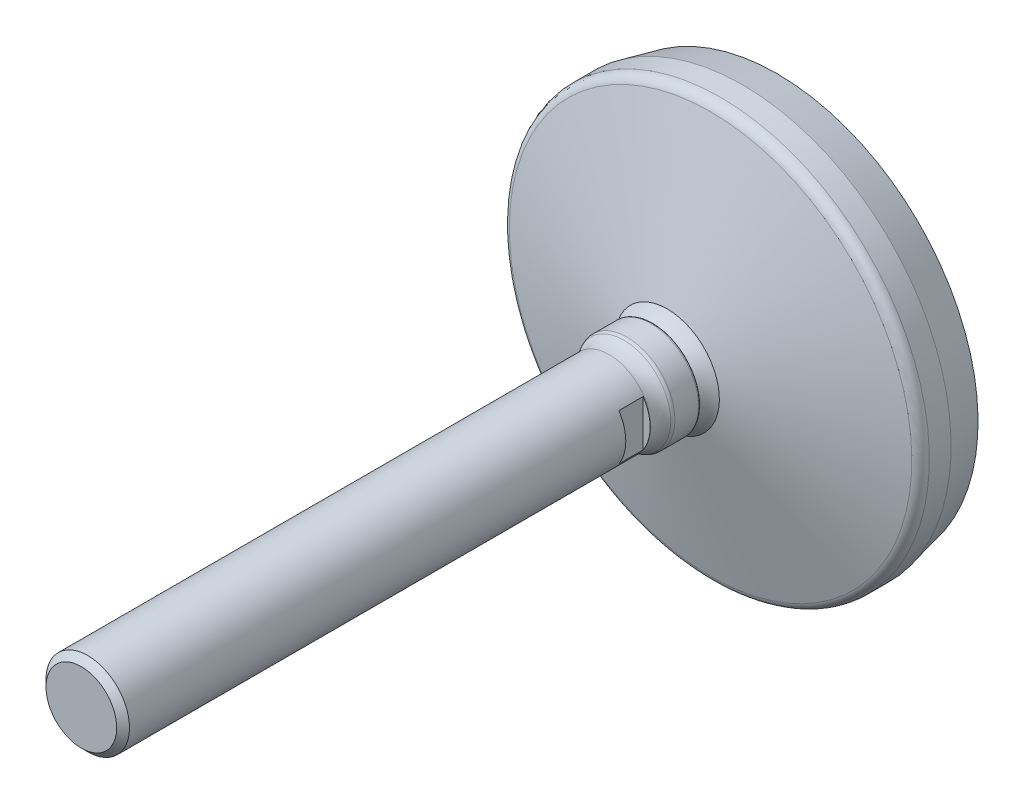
ISO-10303-21;
HEADER;
FILE_DESCRIPTION(('STEP AP214'),'2;1');
FILE_NAME('part.step','',(''),(''),'','','');
FILE_SCHEMA(('AUTOMOTIVE_DESIGN { 1 0 10303 214 1 1 1 1 }'));
ENDSEC;
DATA;
#1=APPLICATION_CONTEXT('core data for automotive mechanical design processes');
#2=APPLICATION_PROTOCOL_DEFINITION('international standard','automotive_design',2000,#1);
#3=PRODUCT_CONTEXT('',#1,'mechanical');
#4=PRODUCT('Part','Part','',(#3));
#5=PRODUCT_RELATED_PRODUCT_CATEGORY('part','',(#4));
#6=PRODUCT_DEFINITION_FORMATION('','',#4);
#7=PRODUCT_DEFINITION_CONTEXT('part definition',#1,'design');
#8=PRODUCT_DEFINITION('design','',#6,#7);
#9=PRODUCT_DEFINITION_SHAPE('','',#8);
#10=(LENGTH_UNIT() NAMED_UNIT(*) SI_UNIT(.MILLI.,.METRE.));
#11=(NAMED_UNIT(*) PLANE_ANGLE_UNIT() SI_UNIT($,.RADIAN.));
#12=(NAMED_UNIT(*) SI_UNIT($,.STERADIAN.) SOLID_ANGLE_UNIT());
#13=UNCERTAINTY_MEASURE_WITH_UNIT(LENGTH_MEASURE(1.E-05),#10,'distance_accuracy_value','');
#14=(GEOMETRIC_REPRESENTATION_CONTEXT(3) GLOBAL_UNCERTAINTY_ASSIGNED_CONTEXT((#13)) GLOBAL_UNIT_ASSIGNED_CONTEXT((#10,
#11,#12)) REPRESENTATION_CONTEXT('',''));
#15=CARTESIAN_POINT('',(0.,0.,0.));
#16=DIRECTION('',(0.,0.,1.));
#17=DIRECTION('',(1.,0.,0.));
#18=AXIS2_PLACEMENT_3D('',#15,#16,#17);
#19=CARTESIAN_POINT('',(0.,0.,40.6420167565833));
#20=DIRECTION('',(0.,0.,-1.));
#21=DIRECTION('',(0.,1.,0.));
#22=AXIS2_PLACEMENT_3D('',#19,#20,#21);
#23=TOROIDAL_SURFACE('',#22,22.8893556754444,12.);
#24=CARTESIAN_POINT('',(0.,0.,31.6));
#25=DIRECTION('',(0.,0.,-1.));
#26=DIRECTION('',(0.,1.,0.));
#27=AXIS2_PLACEMENT_3D('',#24,#25,#26);
#28=CIRCLE('',#27,15.);
#29=CARTESIAN_POINT('',(0.,15.,31.6));
#30=VERTEX_POINT('',#29);
#31=EDGE_CURVE('E86',#30,#30,#28,.T.);
#32=ORIENTED_EDGE('',*,*,#31,.F.);
#33=EDGE_LOOP('',(#32));
#34=FACE_BOUND('',#33,.T.);
#35=CARTESIAN_POINT('',(0.,0.,35.6));
#36=DIRECTION('',(0.,0.,-1.));
#37=DIRECTION('',(0.,1.,0.));
#38=AXIS2_PLACEMENT_3D('',#35,#36,#37);
#39=CIRCLE('',#38,12.);
#40=CARTESIAN_POINT('',(0.,12.,35.6));
#41=VERTEX_POINT('',#40);
#42=EDGE_CURVE('E61',#41,#41,#39,.T.);
#43=ORIENTED_EDGE('',*,*,#42,.T.);
#44=EDGE_LOOP('',(#43));
#45=FACE_BOUND('',#44,.T.);
#46=ADVANCED_FACE('F14',(#34,#45),#23,.F.);
#47=CARTESIAN_POINT('',(0.,0.,31.6));
#48=DIRECTION('',(0.,0.,-1.));
#49=DIRECTION('',(0.,1.,0.));
#50=AXIS2_PLACEMENT_3D('',#47,#48,#49);
#51=CONICAL_SURFACE('',#50,15.,1.2875142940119);
#52=CARTESIAN_POINT('',(0.,0.,19.1292293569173));
#53=DIRECTION('',(0.,0.,-1.));
#54=DIRECTION('',(0.,1.,0.));
#55=AXIS2_PLACEMENT_3D('',#52,#53,#54);
#56=CIRCLE('',#55,57.8385251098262);
#57=CARTESIAN_POINT('',(0.,57.8385251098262,19.1292293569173));
#58=VERTEX_POINT('',#57);
#59=EDGE_CURVE('E89',#58,#58,#56,.T.);
#60=CARTESIAN_POINT('',(0.,57.8385251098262,19.1292293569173));
#61=CARTESIAN_POINT('',(0.,57.3922904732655,19.2591332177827));
#62=CARTESIAN_POINT('',(0.,56.9460558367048,19.3890370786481));
#63=CARTESIAN_POINT('',(0.,56.0535865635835,19.648844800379));
#64=CARTESIAN_POINT('',(0.,55.6073519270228,19.7787486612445));
#65=CARTESIAN_POINT('',(0.,54.7148826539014,20.0385563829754));
#66=CARTESIAN_POINT('',(0.,54.2686480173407,20.1684602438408));
#67=CARTESIAN_POINT('',(0.,53.3761787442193,20.4282679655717));
#68=CARTESIAN_POINT('',(0.,52.9299441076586,20.5581718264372));
#69=CARTESIAN_POINT('',(0.,52.0374748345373,20.817979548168));
#70=CARTESIAN_POINT('',(0.,51.5912401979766,20.9478834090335));
#71=CARTESIAN_POINT('',(0.,50.6987709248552,21.2076911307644));
#72=CARTESIAN_POINT('',(0.,50.2525362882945,21.3375949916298));
#73=CARTESIAN_POINT('',(0.,49.3600670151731,21.5974027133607));
#74=CARTESIAN_POINT('',(0.,48.9138323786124,21.7273065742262));
#75=CARTESIAN_POINT('',(0.,48.021363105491,21.9871142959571));
#76=CARTESIAN_POINT('',(0.,47.5751284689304,22.1170181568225));
#77=CARTESIAN_POINT('',(0.,46.682659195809,22.3768258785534));
#78=CARTESIAN_POINT('',(0.,46.2364245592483,22.5067297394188));
#79=CARTESIAN_POINT('',(0.,45.3439552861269,22.7665374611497));
#80=CARTESIAN_POINT('',(0.,44.8977206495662,22.8964413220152));
#81=CARTESIAN_POINT('',(0.,44.0052513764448,23.1562490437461));
#82=CARTESIAN_POINT('',(0.,43.5590167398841,23.2861529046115));
#83=CARTESIAN_POINT('',(0.,42.6665474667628,23.5459606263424));
#84=CARTESIAN_POINT('',(0.,42.2203128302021,23.6758644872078));
#85=CARTESIAN_POINT('',(0.,41.3278435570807,23.9356722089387));
#86=CARTESIAN_POINT('',(0.,40.88160892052,24.0655760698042));
#87=CARTESIAN_POINT('',(0.,39.9891396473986,24.3253837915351));
#88=CARTESIAN_POINT('',(0.,39.5429050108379,24.4552876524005));
#89=CARTESIAN_POINT('',(0.,38.6504357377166,24.7150953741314));
#90=CARTESIAN_POINT('',(0.,38.2042011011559,24.8449992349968));
#91=CARTESIAN_POINT('',(0.,37.3117318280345,25.1048069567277));
#92=CARTESIAN_POINT('',(0.,36.8654971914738,25.2347108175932));
#93=CARTESIAN_POINT('',(0.,35.9730279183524,25.4945185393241));
#94=CARTESIAN_POINT('',(0.,35.5267932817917,25.6244224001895));
#95=CARTESIAN_POINT('',(0.,34.6343240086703,25.8842301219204));
#96=CARTESIAN_POINT('',(0.,34.1880893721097,26.0141339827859));
#97=CARTESIAN_POINT('',(0.,33.2956200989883,26.2739417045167));
#98=CARTESIAN_POINT('',(0.,32.8493854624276,26.4038455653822));
#99=CARTESIAN_POINT('',(0.,31.9569161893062,26.6636532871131));
#100=CARTESIAN_POINT('',(0.,31.5106815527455,26.7935571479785));
#101=CARTESIAN_POINT('',(0.,30.6182122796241,27.0533648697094));
#102=CARTESIAN_POINT('',(0.,30.1719776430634,27.1832687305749));
#103=CARTESIAN_POINT('',(0.,29.2795083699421,27.4430764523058));
#104=CARTESIAN_POINT('',(0.,28.8332737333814,27.5729803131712));
#105=CARTESIAN_POINT('',(0.,27.94080446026,27.8327880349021));
#106=CARTESIAN_POINT('',(0.,27.4945698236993,27.9626918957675));
#107=CARTESIAN_POINT('',(0.,26.6021005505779,28.2224996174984));
#108=CARTESIAN_POINT('',(0.,26.1558659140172,28.3524034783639));
#109=CARTESIAN_POINT('',(0.,25.2633966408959,28.6122112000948));
#110=CARTESIAN_POINT('',(0.,24.8171620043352,28.7421150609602));
#111=CARTESIAN_POINT('',(0.,23.9246927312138,29.0019227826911));
#112=CARTESIAN_POINT('',(0.,23.4784580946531,29.1318266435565));
#113=CARTESIAN_POINT('',(0.,22.5859888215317,29.3916343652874));
#114=CARTESIAN_POINT('',(0.,22.139754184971,29.5215382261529));
#115=CARTESIAN_POINT('',(0.,21.2472849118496,29.7813459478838));
#116=CARTESIAN_POINT('',(0.,20.801050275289,29.9112498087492));
#117=CARTESIAN_POINT('',(0.,19.9085810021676,30.1710575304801));
#118=CARTESIAN_POINT('',(0.,19.4623463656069,30.3009613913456));
#119=CARTESIAN_POINT('',(0.,18.5698770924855,30.5607691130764));
#120=CARTESIAN_POINT('',(0.,18.1236424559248,30.6906729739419));
#121=CARTESIAN_POINT('',(0.,17.2311731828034,30.9504806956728));
#122=CARTESIAN_POINT('',(0.,16.7849385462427,31.0803845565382));
#123=CARTESIAN_POINT('',(0.,15.8924692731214,31.3401922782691));
#124=CARTESIAN_POINT('',(0.,15.4462346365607,31.4700961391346));
#125=CARTESIAN_POINT('',(0.,15.,31.6));
#126=B_SPLINE_CURVE_WITH_KNOTS('',3,(#60,#61,#62,#63,#64,#65,#66,#67,#68,#69,#70,#71,#72,#73,
#74,#75,#76,#77,#78,#79,#80,#81,#82,#83,#84,#85,#86,#87,#88,#89,#90,#91,#92,#93,#94,#95,#96,#97,
#98,#99,#100,#101,#102,#103,#104,#105,#106,#107,#108,#109,#110,#111,#112,#113,#114,#115,#116,
#117,#118,#119,#120,#121,#122,#123,#124,#125),.UNSPECIFIED.,.F.,.F.,(4,2,2,2,2,2,2,2,2,2,2,2,2,
2,2,2,2,2,2,2,2,2,2,2,2,2,2,2,2,2,2,2,4),(0.,1.39427517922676,2.78855035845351,4.18282553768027,
5.57710071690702,6.97137589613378,8.36565107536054,9.75992625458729,11.154201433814,
12.5484766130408,13.9427517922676,15.3370269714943,16.7313021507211,18.1255773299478,
19.5198525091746,20.9141276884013,22.3084028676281,23.7026780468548,25.0969532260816,
26.4912284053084,27.8855035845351,29.2797787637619,30.6740539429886,32.0683291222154,
33.4626043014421,34.8568794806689,36.2511546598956,37.6454298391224,39.0397050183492,
40.4339801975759,41.8282553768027,43.2225305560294,44.6168057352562),.UNSPECIFIED.);
#127=EDGE_CURVE('BSEAM147',#58,#30,#126,.T.);
#128=ORIENTED_EDGE('',*,*,#59,.F.);
#129=ORIENTED_EDGE('',*,*,#31,.T.);
#130=ORIENTED_EDGE('',*,*,#127,.T.);
#131=ORIENTED_EDGE('',*,*,#127,.F.);
#132=EDGE_LOOP('',(#128,#130,#129,#131));
#133=FACE_BOUND('',#132,.T.);
#134=ADVANCED_FACE('F147',(#133),#51,.T.);
#135=CARTESIAN_POINT('',(0.,0.,16.2487995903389));
#136=DIRECTION('',(0.,0.,-1.));
#137=DIRECTION('',(0.,1.,0.));
#138=AXIS2_PLACEMENT_3D('',#135,#136,#137);
#139=TOROIDAL_SURFACE('',#138,57.,2.99999999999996);
#140=ORIENTED_EDGE('',*,*,#59,.T.);
#141=EDGE_LOOP('',(#140));
#142=FACE_BOUND('',#141,.T.);
#143=CARTESIAN_POINT('',(0.,0.,16.2487995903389));
#144=DIRECTION('',(0.,0.,-1.));
#145=DIRECTION('',(0.,1.,0.));
#146=AXIS2_PLACEMENT_3D('',#143,#144,#145);
#147=CIRCLE('',#146,60.);
#148=CARTESIAN_POINT('',(0.,60.,16.2487995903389));
#149=VERTEX_POINT('',#148);
#150=EDGE_CURVE('E92',#149,#149,#147,.T.);
#151=ORIENTED_EDGE('',*,*,#150,.F.);
#152=EDGE_LOOP('',(#151));
#153=FACE_BOUND('',#152,.T.);
#154=ADVANCED_FACE('F153',(#142,#153),#139,.T.);
#155=CARTESIAN_POINT('',(0.,0.,0.));
#156=DIRECTION('',(0.,0.,-1.));
#157=DIRECTION('',(0.,1.,0.));
#158=AXIS2_PLACEMENT_3D('',#155,#156,#157);
#159=CYLINDRICAL_SURFACE('',#158,60.);
#160=CARTESIAN_POINT('',(0.,0.,10.));
#161=DIRECTION('',(0.,0.,-1.));
#162=DIRECTION('',(0.,1.,0.));
#163=AXIS2_PLACEMENT_3D('',#160,#161,#162);
#164=CIRCLE('',#163,60.);
#165=CARTESIAN_POINT('',(0.,60.,10.));
#166=VERTEX_POINT('',#165);
#167=EDGE_CURVE('E95',#166,#166,#164,.T.);
#168=ORIENTED_EDGE('',*,*,#167,.F.);
#169=EDGE_LOOP('',(#168));
#170=FACE_BOUND('',#169,.T.);
#171=ORIENTED_EDGE('',*,*,#150,.T.);
#172=EDGE_LOOP('',(#171));
#173=FACE_BOUND('',#172,.T.);
#174=ADVANCED_FACE('F198',(#170,#173),#159,.T.);
#175=CARTESIAN_POINT('',(0.,0.,10.));
#176=DIRECTION('',(0.,0.,1.));
#177=DIRECTION('',(0.,-1.,0.));
#178=AXIS2_PLACEMENT_3D('',#175,#176,#177);
#179=CONICAL_SURFACE('',#178,60.,0.221314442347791);
#180=CARTESIAN_POINT('',(0.,0.,0.));
#181=DIRECTION('',(0.,0.,-1.));
#182=DIRECTION('',(0.,1.,0.));
#183=AXIS2_PLACEMENT_3D('',#180,#181,#182);
#184=CIRCLE('',#183,57.75);
#185=CARTESIAN_POINT('',(0.,57.75,0.));
#186=VERTEX_POINT('',#185);
#187=EDGE_CURVE('E98',#186,#186,#184,.T.);
#188=ORIENTED_EDGE('',*,*,#187,.F.);
#189=EDGE_LOOP('',(#188));
#190=FACE_BOUND('',#189,.T.);
#191=ORIENTED_EDGE('',*,*,#167,.T.);
#192=EDGE_LOOP('',(#191));
#193=FACE_BOUND('',#192,.T.);
#194=ADVANCED_FACE('F194',(#190,#193),#179,.T.);
#195=CARTESIAN_POINT('',(57.75,0.,0.));
#196=DIRECTION('',(0.,0.,1.));
#197=DIRECTION('',(0.,-1.,0.));
#198=AXIS2_PLACEMENT_3D('',#195,#196,#197);
#199=PLANE('',#198);
#200=ORIENTED_EDGE('',*,*,#187,.T.);
#201=EDGE_LOOP('',(#200));
#202=FACE_BOUND('',#201,.T.);
#203=ADVANCED_FACE('F187',(#202),#199,.F.);
#204=CARTESIAN_POINT('',(0.,0.,16.));
#205=DIRECTION('',(0.,0.,-1.));
#206=DIRECTION('',(0.,1.,0.));
#207=AXIS2_PLACEMENT_3D('',#204,#205,#206);
#208=CYLINDRICAL_SURFACE('',#207,12.);
#209=CARTESIAN_POINT('',(0.,0.,48.3));
#210=DIRECTION('',(0.,0.,-1.));
#211=DIRECTION('',(0.,1.,0.));
#212=AXIS2_PLACEMENT_3D('',#209,#210,#211);
#213=CIRCLE('',#212,12.);
#214=CARTESIAN_POINT('',(0.,12.,48.3));
#215=VERTEX_POINT('',#214);
#216=EDGE_CURVE('E107',#215,#215,#213,.T.);
#217=ORIENTED_EDGE('',*,*,#216,.F.);
#218=EDGE_LOOP('',(#217));
#219=FACE_BOUND('',#218,.T.);
#220=DIRECTION('',(0.,0.,-1.));
#221=VECTOR('',#220,1.);
#222=CARTESIAN_POINT('',(10.,-6.6332495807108,16.));
#223=LINE('',#222,#221);
#224=CARTESIAN_POINT('',(10.,-6.6332495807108,48.5));
#225=VERTEX_POINT('',#224);
#226=CARTESIAN_POINT('',(10.,-6.6332495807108,55.5));
#227=VERTEX_POINT('',#226);
#228=EDGE_CURVE('E77',#225,#227,#223,.F.);
#229=ORIENTED_EDGE('',*,*,#228,.T.);
#230=CARTESIAN_POINT('',(0.,0.,55.5));
#231=DIRECTION('',(0.,0.,1.));
#232=DIRECTION('',(0.,-1.,0.));
#233=AXIS2_PLACEMENT_3D('',#230,#231,#232);
#234=CIRCLE('',#233,12.);
#235=CARTESIAN_POINT('',(10.,6.6332495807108,55.5));
#236=VERTEX_POINT('',#235);
#237=EDGE_CURVE('E9',#227,#236,#234,.T.);
#238=ORIENTED_EDGE('',*,*,#237,.T.);
#239=DIRECTION('',(0.,0.,-1.));
#240=VECTOR('',#239,1.);
#241=CARTESIAN_POINT('',(10.,6.6332495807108,16.));
#242=LINE('',#241,#240);
#243=CARTESIAN_POINT('',(10.,6.6332495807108,48.5));
#244=VERTEX_POINT('',#243);
#245=EDGE_CURVE('E17',#236,#244,#242,.T.);
#246=ORIENTED_EDGE('',*,*,#245,.T.);
#247=CARTESIAN_POINT('',(0.,0.,48.5));
#248=DIRECTION('',(0.,0.,1.));
#249=DIRECTION('',(0.,-1.,0.));
#250=AXIS2_PLACEMENT_3D('',#247,#248,#249);
#251=CIRCLE('',#250,12.);
#252=EDGE_CURVE('E63',#225,#244,#251,.T.);
#253=ORIENTED_EDGE('',*,*,#252,.F.);
#254=EDGE_LOOP('',(#229,#238,#246,#253));
#255=FACE_BOUND('',#254,.T.);
#256=DIRECTION('',(0.,0.,-1.));
#257=VECTOR('',#256,1.);
#258=CARTESIAN_POINT('',(-10.,6.6332495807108,16.));
#259=LINE('',#258,#257);
#260=CARTESIAN_POINT('',(-10.,6.6332495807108,48.5));
#261=VERTEX_POINT('',#260);
#262=CARTESIAN_POINT('',(-10.,6.6332495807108,55.5));
#263=VERTEX_POINT('',#262);
#264=EDGE_CURVE('E60',#261,#263,#259,.F.);
#265=ORIENTED_EDGE('',*,*,#264,.T.);
#266=CARTESIAN_POINT('',(-10.,-6.6332495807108,55.5));
#267=VERTEX_POINT('',#266);
#268=EDGE_CURVE('E23',#263,#267,#234,.T.);
#269=ORIENTED_EDGE('',*,*,#268,.T.);
#270=DIRECTION('',(0.,0.,-1.));
#271=VECTOR('',#270,1.);
#272=CARTESIAN_POINT('',(-10.,-6.6332495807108,16.));
#273=LINE('',#272,#271);
#274=CARTESIAN_POINT('',(-10.,-6.6332495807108,48.5));
#275=VERTEX_POINT('',#274);
#276=EDGE_CURVE('E67',#267,#275,#273,.T.);
#277=ORIENTED_EDGE('',*,*,#276,.T.);
#278=EDGE_CURVE('E55',#261,#275,#251,.T.);
#279=ORIENTED_EDGE('',*,*,#278,.F.);
#280=EDGE_LOOP('',(#265,#269,#277,#279));
#281=FACE_BOUND('',#280,.T.);
#282=CARTESIAN_POINT('',(0.,0.,198.1595));
#283=DIRECTION('',(0.,0.,-1.));
#284=DIRECTION('',(0.,1.,0.));
#285=AXIS2_PLACEMENT_3D('',#282,#283,#284);
#286=CIRCLE('',#285,12.);
#287=CARTESIAN_POINT('',(0.,12.,198.1595));
#288=VERTEX_POINT('',#287);
#289=EDGE_CURVE('E104',#288,#288,#286,.T.);
#290=ORIENTED_EDGE('',*,*,#289,.T.);
#291=EDGE_LOOP('',(#290));
#292=FACE_BOUND('',#291,.T.);
#293=ADVANCED_FACE('F73',(#219,#255,#281,#292),#208,.T.);
#294=CARTESIAN_POINT('',(0.,0.,48.3));
#295=DIRECTION('',(0.,0.,-1.));
#296=DIRECTION('',(0.,1.,0.));
#297=AXIS2_PLACEMENT_3D('',#294,#295,#296);
#298=TOROIDAL_SURFACE('',#297,19.,7.);
#299=CARTESIAN_POINT('',(0.,0.,44.0456515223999));
#300=DIRECTION('',(0.,0.,-1.));
#301=DIRECTION('',(0.,1.,0.));
#302=AXIS2_PLACEMENT_3D('',#299,#300,#301);
#303=CIRCLE('',#302,13.4411764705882);
#304=CARTESIAN_POINT('',(0.,13.4411764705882,44.0456515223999));
#305=VERTEX_POINT('',#304);
#306=EDGE_CURVE('E110',#305,#305,#303,.T.);
#307=ORIENTED_EDGE('',*,*,#306,.F.);
#308=EDGE_LOOP('',(#307));
#309=FACE_BOUND('',#308,.T.);
#310=ORIENTED_EDGE('',*,*,#216,.T.);
#311=EDGE_LOOP('',(#310));
#312=FACE_BOUND('',#311,.T.);
#313=ADVANCED_FACE('F180',(#309,#312),#298,.F.);
#314=CARTESIAN_POINT('',(0.,0.,43.1340054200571));
#315=DIRECTION('',(0.,0.,-1.));
#316=DIRECTION('',(0.,1.,0.));
#317=AXIS2_PLACEMENT_3D('',#314,#315,#316);
#318=TOROIDAL_SURFACE('',#317,12.25,1.5);
#319=ORIENTED_EDGE('',*,*,#306,.T.);
#320=EDGE_LOOP('',(#319));
#321=FACE_BOUND('',#320,.T.);
#322=CARTESIAN_POINT('',(0.,0.,43.1340054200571));
#323=DIRECTION('',(0.,0.,-1.));
#324=DIRECTION('',(0.,1.,0.));
#325=AXIS2_PLACEMENT_3D('',#322,#323,#324);
#326=CIRCLE('',#325,13.75);
#327=CARTESIAN_POINT('',(0.,13.75,43.1340054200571));
#328=VERTEX_POINT('',#327);
#329=EDGE_CURVE('E113',#328,#328,#326,.T.);
#330=ORIENTED_EDGE('',*,*,#329,.F.);
#331=EDGE_LOOP('',(#330));
#332=FACE_BOUND('',#331,.T.);
#333=ADVANCED_FACE('F173',(#321,#332),#318,.T.);
#334=CARTESIAN_POINT('',(0.,0.,16.));
#335=DIRECTION('',(0.,0.,-1.));
#336=DIRECTION('',(0.,1.,0.));
#337=AXIS2_PLACEMENT_3D('',#334,#335,#336);
#338=CYLINDRICAL_SURFACE('',#337,13.75);
#339=CARTESIAN_POINT('',(0.,0.,36.35));
#340=DIRECTION('',(0.,0.,-1.));
#341=DIRECTION('',(0.,1.,0.));
#342=AXIS2_PLACEMENT_3D('',#339,#340,#341);
#343=CIRCLE('',#342,13.75);
#344=CARTESIAN_POINT('',(0.,13.75,36.35));
#345=VERTEX_POINT('',#344);
#346=EDGE_CURVE('E116',#345,#345,#343,.T.);
#347=ORIENTED_EDGE('',*,*,#346,.F.);
#348=EDGE_LOOP('',(#347));
#349=FACE_BOUND('',#348,.T.);
#350=ORIENTED_EDGE('',*,*,#329,.T.);
#351=EDGE_LOOP('',(#350));
#352=FACE_BOUND('',#351,.T.);
#353=ADVANCED_FACE('F166',(#349,#352),#338,.T.);
#354=CARTESIAN_POINT('',(0.,0.,36.35));
#355=DIRECTION('',(0.,0.,-1.));
#356=DIRECTION('',(0.,1.,0.));
#357=AXIS2_PLACEMENT_3D('',#354,#355,#356);
#358=TOROIDAL_SURFACE('',#357,13.,0.75);
#359=ORIENTED_EDGE('',*,*,#346,.T.);
#360=EDGE_LOOP('',(#359));
#361=FACE_BOUND('',#360,.T.);
#362=CARTESIAN_POINT('',(0.,0.,35.6));
#363=DIRECTION('',(0.,0.,-1.));
#364=DIRECTION('',(0.,1.,0.));
#365=AXIS2_PLACEMENT_3D('',#362,#363,#364);
#366=CIRCLE('',#365,13.);
#367=CARTESIAN_POINT('',(0.,13.,35.6));
#368=VERTEX_POINT('',#367);
#369=EDGE_CURVE('E119',#368,#368,#366,.T.);
#370=ORIENTED_EDGE('',*,*,#369,.F.);
#371=EDGE_LOOP('',(#370));
#372=FACE_BOUND('',#371,.T.);
#373=ADVANCED_FACE('F161',(#361,#372),#358,.T.);
#374=CARTESIAN_POINT('',(13.,0.,35.6));
#375=DIRECTION('',(0.,0.,1.));
#376=DIRECTION('',(0.,-1.,0.));
#377=AXIS2_PLACEMENT_3D('',#374,#375,#376);
#378=PLANE('',#377);
#379=ORIENTED_EDGE('',*,*,#42,.F.);
#380=EDGE_LOOP('',(#379));
#381=FACE_BOUND('',#380,.T.);
#382=ORIENTED_EDGE('',*,*,#369,.T.);
#383=EDGE_LOOP('',(#382));
#384=FACE_BOUND('',#383,.T.);
#385=ADVANCED_FACE('F145',(#381,#384),#378,.F.);
#386=CARTESIAN_POINT('',(0.,0.,48.5));
#387=DIRECTION('',(0.,0.,1.));
#388=DIRECTION('',(0.,-1.,0.));
#389=AXIS2_PLACEMENT_3D('',#386,#387,#388);
#390=PLANE('',#389);
#391=ORIENTED_EDGE('',*,*,#278,.T.);
#392=DIRECTION('',(0.,-1.,0.));
#393=VECTOR('',#392,1.);
#394=CARTESIAN_POINT('',(-10.,24.,48.5));
#395=LINE('',#394,#393);
#396=EDGE_CURVE('E29',#261,#275,#395,.T.);
#397=ORIENTED_EDGE('',*,*,#396,.F.);
#398=EDGE_LOOP('',(#391,#397));
#399=FACE_BOUND('',#398,.T.);
#400=ADVANCED_FACE('F56',(#399),#390,.T.);
#401=CARTESIAN_POINT('',(0.,0.,55.5));
#402=DIRECTION('',(0.,0.,1.));
#403=DIRECTION('',(0.,-1.,0.));
#404=AXIS2_PLACEMENT_3D('',#401,#402,#403);
#405=PLANE('',#404);
#406=DIRECTION('',(0.,-1.,0.));
#407=VECTOR('',#406,1.);
#408=CARTESIAN_POINT('',(-10.,24.,55.5));
#409=LINE('',#408,#407);
#410=EDGE_CURVE('E121',#263,#267,#409,.T.);
#411=ORIENTED_EDGE('',*,*,#410,.T.);
#412=ORIENTED_EDGE('',*,*,#268,.F.);
#413=EDGE_LOOP('',(#411,#412));
#414=FACE_BOUND('',#413,.T.);
#415=ADVANCED_FACE('F142',(#414),#405,.F.);
#416=CARTESIAN_POINT('',(-10.,24.,55.5));
#417=DIRECTION('',(1.,0.,0.));
#418=DIRECTION('',(0.,1.,0.));
#419=AXIS2_PLACEMENT_3D('',#416,#417,#418);
#420=PLANE('',#419);
#421=ORIENTED_EDGE('',*,*,#410,.F.);
#422=ORIENTED_EDGE('',*,*,#264,.F.);
#423=ORIENTED_EDGE('',*,*,#396,.T.);
#424=ORIENTED_EDGE('',*,*,#276,.F.);
#425=EDGE_LOOP('',(#421,#422,#423,#424));
#426=FACE_BOUND('',#425,.T.);
#427=ADVANCED_FACE('F66',(#426),#420,.F.);
#428=CARTESIAN_POINT('',(10.,-24.,55.5));
#429=DIRECTION('',(-1.,0.,0.));
#430=DIRECTION('',(0.,-1.,0.));
#431=AXIS2_PLACEMENT_3D('',#428,#429,#430);
#432=PLANE('',#431);
#433=DIRECTION('',(0.,1.,0.));
#434=VECTOR('',#433,1.);
#435=CARTESIAN_POINT('',(10.,-24.,55.5));
#436=LINE('',#435,#434);
#437=EDGE_CURVE('E69',#227,#236,#436,.T.);
#438=ORIENTED_EDGE('',*,*,#437,.F.);
#439=ORIENTED_EDGE('',*,*,#228,.F.);
#440=DIRECTION('',(0.,1.,0.));
#441=VECTOR('',#440,1.);
#442=CARTESIAN_POINT('',(10.,-24.,48.5));
#443=LINE('',#442,#441);
#444=EDGE_CURVE('E70',#225,#244,#443,.T.);
#445=ORIENTED_EDGE('',*,*,#444,.T.);
#446=ORIENTED_EDGE('',*,*,#245,.F.);
#447=EDGE_LOOP('',(#438,#439,#445,#446));
#448=FACE_BOUND('',#447,.T.);
#449=ADVANCED_FACE('F127',(#448),#432,.F.);
#450=ORIENTED_EDGE('',*,*,#437,.T.);
#451=ORIENTED_EDGE('',*,*,#237,.F.);
#452=EDGE_LOOP('',(#450,#451));
#453=FACE_BOUND('',#452,.T.);
#454=ADVANCED_FACE('F126',(#453),#405,.F.);
#455=ORIENTED_EDGE('',*,*,#444,.F.);
#456=ORIENTED_EDGE('',*,*,#252,.T.);
#457=EDGE_LOOP('',(#455,#456));
#458=FACE_BOUND('',#457,.T.);
#459=ADVANCED_FACE('F128',(#458),#390,.T.);
#460=CARTESIAN_POINT('',(0.,0.,200.));
#461=DIRECTION('',(0.,0.,-1.));
#462=DIRECTION('',(0.,1.,0.));
#463=AXIS2_PLACEMENT_3D('',#460,#461,#462);
#464=PLANE('',#463);
#465=CARTESIAN_POINT('',(0.,0.,200.));
#466=DIRECTION('',(0.,0.,-1.));
#467=DIRECTION('',(0.,1.,0.));
#468=AXIS2_PLACEMENT_3D('',#465,#466,#467);
#469=CIRCLE('',#468,10.1595);
#470=CARTESIAN_POINT('',(0.,10.1595,200.));
#471=VERTEX_POINT('',#470);
#472=EDGE_CURVE('E101',#471,#471,#469,.T.);
#473=ORIENTED_EDGE('',*,*,#472,.F.);
#474=EDGE_LOOP('',(#473));
#475=FACE_BOUND('',#474,.T.);
#476=ADVANCED_FACE('F130',(#475),#464,.F.);
#477=CARTESIAN_POINT('',(0.,0.,200.));
#478=DIRECTION('',(0.,0.,-1.));
#479=DIRECTION('',(0.,1.,0.));
#480=AXIS2_PLACEMENT_3D('',#477,#478,#479);
#481=CONICAL_SURFACE('',#480,10.1595,0.785398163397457);
#482=ORIENTED_EDGE('',*,*,#289,.F.);
#483=EDGE_LOOP('',(#482));
#484=FACE_BOUND('',#483,.T.);
#485=ORIENTED_EDGE('',*,*,#472,.T.);
#486=EDGE_LOOP('',(#485));
#487=FACE_BOUND('',#486,.T.);
#488=ADVANCED_FACE('F138',(#484,#487),#481,.T.);
#489=CLOSED_SHELL('',(#46,#134,#154,#174,#194,#203,#293,#313,#333,#353,#373,#385,#400,#415,#427,
#449,#454,#459,#476,#488));
#490=MANIFOLD_SOLID_BREP('B1',#489);
#491=ADVANCED_BREP_SHAPE_REPRESENTATION('',(#18,#490),#14);
#492=SHAPE_DEFINITION_REPRESENTATION(#9,#491);
ENDSEC;
END-ISO-10303-21;
